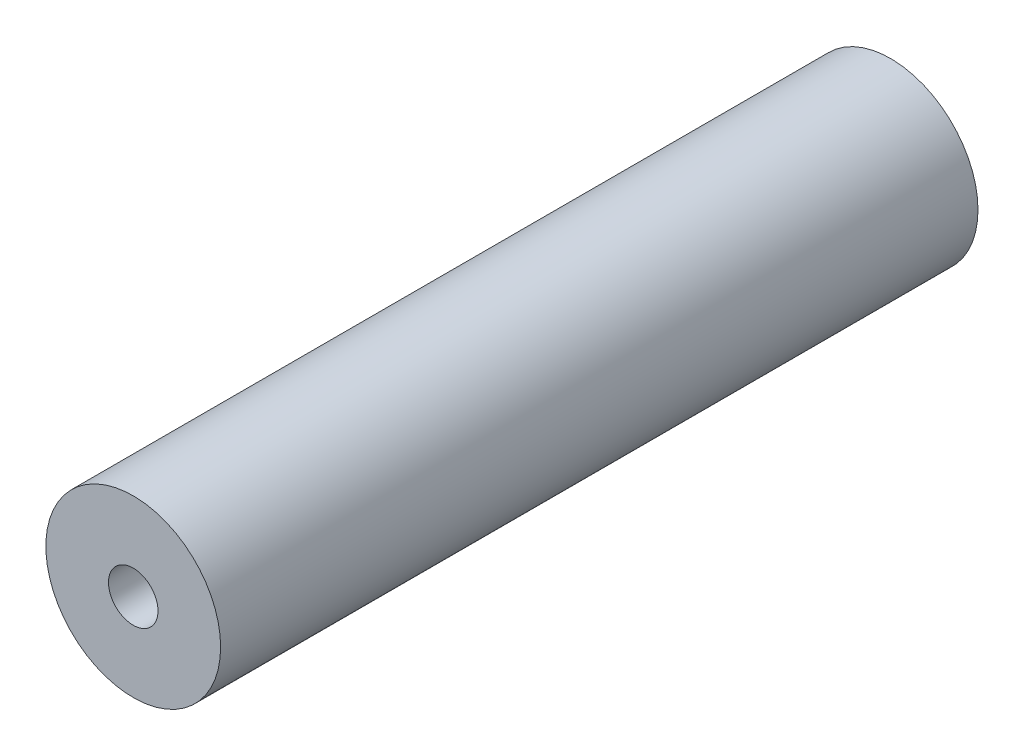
from build123d import *

# Parameters (mm, degrees)
ESQUISSE1_R                = 15
EXTRUSION1_DEPTH           = 130
TROU_TARAUD_M10X1_51_D     = 8.5
TROU_TARAUD_M10X1_51_DEPTH = 29.5
TROU_TARAUD_M10X1_51_TIP   = 2.553657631
TROU_TARAUD_M10X1_52_D     = 8.5
TROU_TARAUD_M10X1_52_DEPTH = 29.5
TROU_TARAUD_M10X1_52_TIP   = 2.553657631


with BuildPart() as part:
    # Esquisse1 → Extrusion1 (new body)
    with BuildSketch(Plane.XY):
        Circle(ESQUISSE1_R)
    extrude(amount=EXTRUSION1_DEPTH)

    # Trou taraud_ M10x1.51
    with Locations(Plane.XY.offset(130)):
        with Locations((0, 0)):
            Hole(TROU_TARAUD_M10X1_51_D / 2, depth=TROU_TARAUD_M10X1_51_DEPTH)
            with Locations((0, 0, -(TROU_TARAUD_M10X1_51_DEPTH + TROU_TARAUD_M10X1_51_TIP / 2))):  # 118° drill point
                Cone(0, TROU_TARAUD_M10X1_51_D / 2, TROU_TARAUD_M10X1_51_TIP, mode=Mode.SUBTRACT)

    # Trou taraud_ M10x1.52
    with Locations(Plane(origin=(0, 0, 0), x_dir=(-1, 0, 0), z_dir=(0, 0, -1))):
        with Locations((0, 0)):
            Hole(TROU_TARAUD_M10X1_52_D / 2, depth=TROU_TARAUD_M10X1_52_DEPTH)
            with Locations((0, 0, -(TROU_TARAUD_M10X1_52_DEPTH + TROU_TARAUD_M10X1_52_TIP / 2))):  # 118° drill point
                Cone(0, TROU_TARAUD_M10X1_52_D / 2, TROU_TARAUD_M10X1_52_TIP, mode=Mode.SUBTRACT)


solid = part.part
